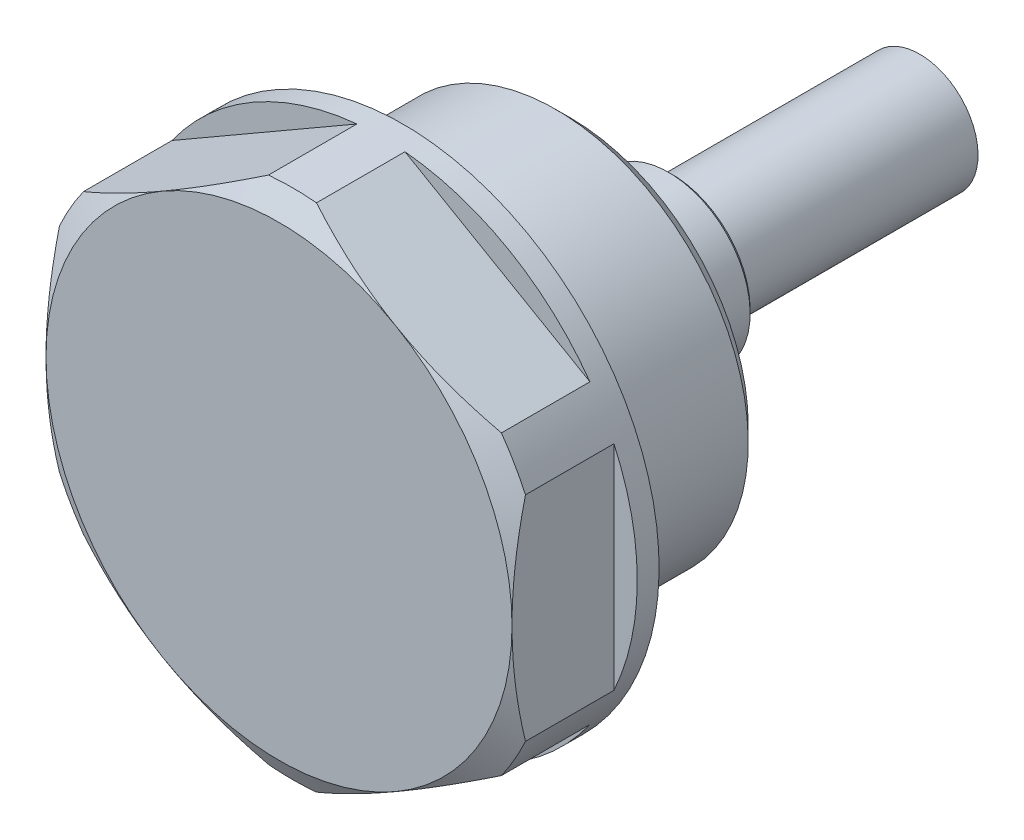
ISO-10303-21;
HEADER;
FILE_DESCRIPTION(('STEP AP214'),'2;1');
FILE_NAME('part.step','',(''),(''),'','','');
FILE_SCHEMA(('AUTOMOTIVE_DESIGN { 1 0 10303 214 1 1 1 1 }'));
ENDSEC;
DATA;
#1=APPLICATION_CONTEXT('core data for automotive mechanical design processes');
#2=APPLICATION_PROTOCOL_DEFINITION('international standard','automotive_design',2000,#1);
#3=PRODUCT_CONTEXT('',#1,'mechanical');
#4=PRODUCT('Part','Part','',(#3));
#5=PRODUCT_RELATED_PRODUCT_CATEGORY('part','',(#4));
#6=PRODUCT_DEFINITION_FORMATION('','',#4);
#7=PRODUCT_DEFINITION_CONTEXT('part definition',#1,'design');
#8=PRODUCT_DEFINITION('design','',#6,#7);
#9=PRODUCT_DEFINITION_SHAPE('','',#8);
#10=(LENGTH_UNIT() NAMED_UNIT(*) SI_UNIT(.MILLI.,.METRE.));
#11=(NAMED_UNIT(*) PLANE_ANGLE_UNIT() SI_UNIT($,.RADIAN.));
#12=(NAMED_UNIT(*) SI_UNIT($,.STERADIAN.) SOLID_ANGLE_UNIT());
#13=UNCERTAINTY_MEASURE_WITH_UNIT(LENGTH_MEASURE(1.E-05),#10,'distance_accuracy_value','');
#14=(GEOMETRIC_REPRESENTATION_CONTEXT(3) GLOBAL_UNCERTAINTY_ASSIGNED_CONTEXT((#13)) GLOBAL_UNIT_ASSIGNED_CONTEXT((#10,
#11,#12)) REPRESENTATION_CONTEXT('',''));
#15=CARTESIAN_POINT('',(0.,0.,0.));
#16=DIRECTION('',(0.,0.,1.));
#17=DIRECTION('',(1.,0.,0.));
#18=AXIS2_PLACEMENT_3D('',#15,#16,#17);
#19=CARTESIAN_POINT('',(0.,0.,9.));
#20=DIRECTION('',(0.,0.,-1.));
#21=DIRECTION('',(0.,-1.,0.));
#22=AXIS2_PLACEMENT_3D('',#19,#20,#21);
#23=CONICAL_SURFACE('',#22,16.,1.0471975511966);
#24=CARTESIAN_POINT('',(0.,0.,8.0762395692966));
#25=DIRECTION('',(0.,0.,-1.));
#26=DIRECTION('',(0.,-1.,0.));
#27=AXIS2_PLACEMENT_3D('',#24,#25,#26);
#28=CIRCLE('',#27,17.6);
#29=CARTESIAN_POINT('',(-1.65019685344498,17.5224670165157,8.07623956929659));
#30=VERTEX_POINT('',#29);
#31=CARTESIAN_POINT('',(1.65019685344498,17.5224670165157,8.0762395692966));
#32=VERTEX_POINT('',#31);
#33=EDGE_CURVE('E188',#30,#32,#28,.T.);
#34=ORIENTED_EDGE('',*,*,#33,.F.);
#35=CARTESIAN_POINT('',(-1.6494767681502,17.5228827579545,8.0760395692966));
#36=CARTESIAN_POINT('',(-1.98845285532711,17.327174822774,8.17020232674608));
#37=CARTESIAN_POINT('',(-2.32869743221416,17.130734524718,8.25847050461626));
#38=CARTESIAN_POINT('',(-3.01163532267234,16.7364401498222,8.42191829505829));
#39=CARTESIAN_POINT('',(-3.35432933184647,16.5385856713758,8.49709402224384));
#40=CARTESIAN_POINT('',(-4.04226988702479,16.1414030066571,8.63307784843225));
#41=CARTESIAN_POINT('',(-4.38751890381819,15.942073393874,8.69386941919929));
#42=CARTESIAN_POINT('',(-5.07979335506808,15.5423885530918,8.79975737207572));
#43=CARTESIAN_POINT('',(-5.42681860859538,15.3420334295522,8.84485532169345));
#44=CARTESIAN_POINT('',(-6.11541078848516,14.944474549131,8.91765204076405));
#45=CARTESIAN_POINT('',(-6.45695198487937,14.7472856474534,8.94567335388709));
#46=CARTESIAN_POINT('',(-7.14077192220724,14.3524820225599,8.98504305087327));
#47=CARTESIAN_POINT('',(-7.48305068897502,14.1548672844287,8.99639084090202));
#48=CARTESIAN_POINT('',(-8.16745430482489,13.7597266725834,9.00214002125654));
#49=CARTESIAN_POINT('',(-8.50957907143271,13.5622008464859,8.99655436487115));
#50=CARTESIAN_POINT('',(-9.19328411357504,13.1674635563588,8.96860000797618));
#51=CARTESIAN_POINT('',(-9.53486442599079,12.9702520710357,8.94623249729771));
#52=CARTESIAN_POINT('',(-10.2508802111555,12.5568601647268,8.88219224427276));
#53=CARTESIAN_POINT('',(-10.6252015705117,12.340745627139,8.83881945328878));
#54=CARTESIAN_POINT('',(-11.3719028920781,11.9096374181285,8.73353503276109));
#55=CARTESIAN_POINT('',(-11.7442826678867,11.6946438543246,8.67162165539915));
#56=CARTESIAN_POINT('',(-12.4907085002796,11.2636946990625,8.52994272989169));
#57=CARTESIAN_POINT('',(-12.864727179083,11.0477549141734,8.44998666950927));
#58=CARTESIAN_POINT('',(-13.6098439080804,10.617561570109,8.27436666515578));
#59=CARTESIAN_POINT('',(-13.9809430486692,10.4033073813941,8.17870890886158));
#60=CARTESIAN_POINT('',(-14.3505232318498,10.1899301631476,8.0760395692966));
#61=B_SPLINE_CURVE_WITH_KNOTS('',3,(#35,#36,#37,#38,#39,#40,#41,#42,#43,#44,#45,#46,#47,#48,#49,
#50,#51,#52,#53,#54,#55,#56,#57,#58,#59,#60),.UNSPECIFIED.,.F.,.F.,(4,2,2,2,2,2,2,2,2,2,2,2,4),
(0.,1.20777071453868,2.41589924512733,3.62540931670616,4.83479854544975,6.02057312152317,
7.20638992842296,8.39129987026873,9.5761258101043,10.8788915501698,12.1817801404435,
13.4991293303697,14.8159606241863),.UNSPECIFIED.);
#62=CARTESIAN_POINT('',(-8.,13.856406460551,9.));
#63=VERTEX_POINT('',#62);
#64=EDGE_CURVE('E291',#30,#63,#61,.T.);
#65=ORIENTED_EDGE('',*,*,#64,.T.);
#66=CARTESIAN_POINT('',(0.,0.,9.));
#67=DIRECTION('',(0.,0.,-1.));
#68=DIRECTION('',(0.,-1.,0.));
#69=AXIS2_PLACEMENT_3D('',#66,#67,#68);
#70=CIRCLE('',#69,16.);
#71=CARTESIAN_POINT('',(8.,13.856406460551,9.));
#72=VERTEX_POINT('',#71);
#73=EDGE_CURVE('E170',#63,#72,#70,.T.);
#74=ORIENTED_EDGE('',*,*,#73,.T.);
#75=CARTESIAN_POINT('',(14.3505232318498,10.1899301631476,8.0760395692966));
#76=CARTESIAN_POINT('',(14.0115471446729,10.385638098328,8.17020232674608));
#77=CARTESIAN_POINT('',(13.6713025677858,10.5820783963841,8.25847050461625));
#78=CARTESIAN_POINT('',(12.9883646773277,10.9763727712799,8.42191829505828));
#79=CARTESIAN_POINT('',(12.6456706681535,11.1742272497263,8.49709402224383));
#80=CARTESIAN_POINT('',(11.9577301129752,11.5714099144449,8.63307784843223));
#81=CARTESIAN_POINT('',(11.6124810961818,11.770739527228,8.69386941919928));
#82=CARTESIAN_POINT('',(10.9202066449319,12.1704243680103,8.7997573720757));
#83=CARTESIAN_POINT('',(10.5731813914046,12.3707794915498,8.84485532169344));
#84=CARTESIAN_POINT('',(9.88458921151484,12.7683383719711,8.91765204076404));
#85=CARTESIAN_POINT('',(9.54304801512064,12.9655272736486,8.94567335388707));
#86=CARTESIAN_POINT('',(8.85922807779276,13.3603308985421,8.98504305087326));
#87=CARTESIAN_POINT('',(8.51694931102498,13.5579456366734,8.99639084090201));
#88=CARTESIAN_POINT('',(7.83254569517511,13.9530862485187,9.00214002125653));
#89=CARTESIAN_POINT('',(7.4904209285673,14.1506120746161,8.99655436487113));
#90=CARTESIAN_POINT('',(6.80671588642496,14.5453493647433,8.96860000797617));
#91=CARTESIAN_POINT('',(6.46513557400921,14.7425608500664,8.9462324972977));
#92=CARTESIAN_POINT('',(5.74911978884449,15.1559527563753,8.88219224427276));
#93=CARTESIAN_POINT('',(5.37479842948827,15.372067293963,8.83881945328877));
#94=CARTESIAN_POINT('',(4.62809710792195,15.8031755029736,8.73353503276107));
#95=CARTESIAN_POINT('',(4.25571733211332,16.0181690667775,8.67162165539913));
#96=CARTESIAN_POINT('',(3.50929149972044,16.4491182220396,8.52994272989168));
#97=CARTESIAN_POINT('',(3.135272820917,16.6650580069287,8.44998666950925));
#98=CARTESIAN_POINT('',(2.39015609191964,17.095251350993,8.27436666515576));
#99=CARTESIAN_POINT('',(2.01905695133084,17.309505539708,8.17870890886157));
#100=CARTESIAN_POINT('',(1.64947676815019,17.5228827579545,8.0760395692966));
#101=B_SPLINE_CURVE_WITH_KNOTS('',3,(#75,#76,#77,#78,#79,#80,#81,#82,#83,#84,#85,#86,#87,#88,
#89,#90,#91,#92,#93,#94,#95,#96,#97,#98,#99,#100),.UNSPECIFIED.,.F.,.F.,(4,2,2,2,2,2,2,2,2,2,2,
2,4),(0.,1.20777071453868,2.41589924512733,3.62540931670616,4.83479854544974,6.02057312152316,
7.20638992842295,8.39129987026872,9.57612581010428,10.8788915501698,12.1817801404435,
13.4991293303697,14.8159606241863),.UNSPECIFIED.);
#102=EDGE_CURVE('E193',#72,#32,#101,.T.);
#103=ORIENTED_EDGE('',*,*,#102,.T.);
#104=EDGE_LOOP('',(#34,#65,#74,#103));
#105=FACE_BOUND('',#104,.T.);
#106=ADVANCED_FACE('F14',(#105),#23,.T.);
#107=CARTESIAN_POINT('',(-8.,-13.856406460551,9.));
#108=VERTEX_POINT('',#107);
#109=CARTESIAN_POINT('',(-16.,0.,9.));
#110=VERTEX_POINT('',#109);
#111=EDGE_CURVE('E171',#108,#110,#70,.T.);
#112=ORIENTED_EDGE('',*,*,#111,.T.);
#113=CARTESIAN_POINT('',(-16.,-24.4294713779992,1.37740391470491));
#114=CARTESIAN_POINT('',(-16.,-24.0785103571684,1.54690784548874));
#115=CARTESIAN_POINT('',(-16.,-23.72712313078,1.71552887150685));
#116=CARTESIAN_POINT('',(-16.,-23.023406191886,2.05080229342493));
#117=CARTESIAN_POINT('',(-16.,-22.6710764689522,2.21745466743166));
#118=CARTESIAN_POINT('',(-16.,-21.6124341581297,2.71420337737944));
#119=CARTESIAN_POINT('',(-16.,-20.9045837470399,3.04103544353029));
#120=CARTESIAN_POINT('',(-16.,-19.4798811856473,3.68575584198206));
#121=CARTESIAN_POINT('',(-16.,-18.7630006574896,4.0035816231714));
#122=CARTESIAN_POINT('',(-16.,-17.3233222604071,4.62548601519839));
#123=CARTESIAN_POINT('',(-16.,-16.6005247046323,4.92956534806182));
#124=CARTESIAN_POINT('',(-16.,-15.139216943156,5.52378605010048));
#125=CARTESIAN_POINT('',(-16.,-14.4006220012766,5.81372013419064));
#126=CARTESIAN_POINT('',(-16.,-12.914690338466,6.37070635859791));
#127=CARTESIAN_POINT('',(-16.,-12.167352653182,6.63775594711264));
#128=CARTESIAN_POINT('',(-16.,-10.6643298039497,7.14174292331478));
#129=CARTESIAN_POINT('',(-16.,-9.90866649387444,7.37874494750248));
#130=CARTESIAN_POINT('',(-16.,-8.3865273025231,7.81490580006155));
#131=CARTESIAN_POINT('',(-16.,-7.62005494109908,8.01407665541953));
#132=CARTESIAN_POINT('',(-16.,-6.46208899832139,8.27713785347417));
#133=CARTESIAN_POINT('',(-16.,-6.0746264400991,8.35889167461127));
#134=CARTESIAN_POINT('',(-16.,-5.29713679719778,8.50920089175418));
#135=CARTESIAN_POINT('',(-16.,-4.90710977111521,8.57775658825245));
#136=CARTESIAN_POINT('',(-16.,-4.12475809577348,8.70045020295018));
#137=CARTESIAN_POINT('',(-16.,-3.7324333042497,8.75458721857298));
#138=CARTESIAN_POINT('',(-16.,-2.94594126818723,8.84735381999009));
#139=CARTESIAN_POINT('',(-16.,-2.5517740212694,8.88598338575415));
#140=CARTESIAN_POINT('',(-16.,-1.7646332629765,8.94669888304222));
#141=CARTESIAN_POINT('',(-16.,-1.37166764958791,8.96888653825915));
#142=CARTESIAN_POINT('',(-16.,-0.585151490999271,8.99660263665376));
#143=CARTESIAN_POINT('',(-16.,-0.191600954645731,9.00213132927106));
#144=CARTESIAN_POINT('',(-16.,0.595272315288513,8.99639873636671));
#145=CARTESIAN_POINT('',(-16.,0.988595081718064,8.98514202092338));
#146=CARTESIAN_POINT('',(-16.,1.77442214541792,8.94611641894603));
#147=CARTESIAN_POINT('',(-16.,2.16692640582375,8.91834680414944));
#148=CARTESIAN_POINT('',(-16.,3.12020758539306,8.83142550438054));
#149=CARTESIAN_POINT('',(-16.,3.68023484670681,8.76389096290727));
#150=CARTESIAN_POINT('',(-16.,4.79585493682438,8.5989822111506));
#151=CARTESIAN_POINT('',(-16.,5.35144708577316,8.5016035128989));
#152=CARTESIAN_POINT('',(-16.,7.01256338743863,8.16959106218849));
#153=CARTESIAN_POINT('',(-16.,8.11025114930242,7.89530452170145));
#154=CARTESIAN_POINT('',(-16.,9.75207140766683,7.42294207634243));
#155=CARTESIAN_POINT('',(-16.,10.3047967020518,7.25304477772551));
#156=CARTESIAN_POINT('',(-16.,11.4049071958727,6.89645934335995));
#157=CARTESIAN_POINT('',(-16.,11.9522919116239,6.70976970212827));
#158=CARTESIAN_POINT('',(-16.,13.0389903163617,6.32356624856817));
#159=CARTESIAN_POINT('',(-16.,13.5783321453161,6.1241309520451));
#160=CARTESIAN_POINT('',(-16.,14.3839563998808,5.81641618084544));
#161=CARTESIAN_POINT('',(-16.,14.6518900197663,5.71243512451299));
#162=CARTESIAN_POINT('',(-16.,15.1867192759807,5.50185106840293));
#163=CARTESIAN_POINT('',(-16.,15.4536149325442,5.3952481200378));
#164=CARTESIAN_POINT('',(-16.,15.7200277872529,5.28745278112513));
#165=B_SPLINE_CURVE_WITH_KNOTS('',3,(#113,#114,#115,#116,#117,#118,#119,#120,#121,#122,#123,
#124,#125,#126,#127,#128,#129,#130,#131,#132,#133,#134,#135,#136,#137,#138,#139,#140,#141,#142,
#143,#144,#145,#146,#147,#148,#149,#150,#151,#152,#153,#154,#155,#156,#157,#158,#159,#160,#161,
#162,#163,#164),.UNSPECIFIED.,.F.,.F.,(4,2,2,2,2,2,2,2,2,2,2,2,2,2,2,2,2,2,2,2,2,2,2,2,2,4),(0.,
1.16924830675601,2.33850960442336,4.67741658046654,7.02983092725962,9.38212157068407,
11.7622223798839,14.1425882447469,16.5177434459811,18.8921422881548,20.0799344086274,
21.2676994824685,22.4555388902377,23.6433798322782,24.8238089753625,26.0042204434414,
27.1843105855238,28.3644527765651,30.055744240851,31.7472901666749,35.1369159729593,
36.8715249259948,38.6062895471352,40.331241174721,41.1934382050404,42.0556183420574),.UNSPECIFIED.);
#166=CARTESIAN_POINT('',(-16.,-7.33212111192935,8.0762395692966));
#167=VERTEX_POINT('',#166);
#168=EDGE_CURVE('E278',#110,#167,#165,.F.);
#169=ORIENTED_EDGE('',*,*,#168,.T.);
#170=CARTESIAN_POINT('',(-14.349803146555,-10.1903459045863,8.07623956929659));
#171=VERTEX_POINT('',#170);
#172=EDGE_CURVE('E347',#171,#167,#28,.T.);
#173=ORIENTED_EDGE('',*,*,#172,.F.);
#174=CARTESIAN_POINT('',(-14.3505232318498,-10.1899301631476,8.0760395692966));
#175=CARTESIAN_POINT('',(-14.0115471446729,-10.385638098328,8.17020232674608));
#176=CARTESIAN_POINT('',(-13.6713025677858,-10.5820783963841,8.25847050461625));
#177=CARTESIAN_POINT('',(-12.9883646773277,-10.9763727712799,8.42191829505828));
#178=CARTESIAN_POINT('',(-12.6456706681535,-11.1742272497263,8.49709402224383));
#179=CARTESIAN_POINT('',(-11.9577301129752,-11.5714099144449,8.63307784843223));
#180=CARTESIAN_POINT('',(-11.6124810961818,-11.770739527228,8.69386941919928));
#181=CARTESIAN_POINT('',(-10.9202066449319,-12.1704243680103,8.7997573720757));
#182=CARTESIAN_POINT('',(-10.5731813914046,-12.3707794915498,8.84485532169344));
#183=CARTESIAN_POINT('',(-9.88458921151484,-12.7683383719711,8.91765204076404));
#184=CARTESIAN_POINT('',(-9.54304801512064,-12.9655272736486,8.94567335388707));
#185=CARTESIAN_POINT('',(-8.85922807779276,-13.3603308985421,8.98504305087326));
#186=CARTESIAN_POINT('',(-8.51694931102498,-13.5579456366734,8.99639084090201));
#187=CARTESIAN_POINT('',(-7.83254569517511,-13.9530862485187,9.00214002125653));
#188=CARTESIAN_POINT('',(-7.4904209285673,-14.1506120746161,8.99655436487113));
#189=CARTESIAN_POINT('',(-6.80671588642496,-14.5453493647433,8.96860000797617));
#190=CARTESIAN_POINT('',(-6.46513557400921,-14.7425608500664,8.9462324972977));
#191=CARTESIAN_POINT('',(-5.74911978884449,-15.1559527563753,8.88219224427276));
#192=CARTESIAN_POINT('',(-5.37479842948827,-15.372067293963,8.83881945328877));
#193=CARTESIAN_POINT('',(-4.62809710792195,-15.8031755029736,8.73353503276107));
#194=CARTESIAN_POINT('',(-4.25571733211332,-16.0181690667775,8.67162165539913));
#195=CARTESIAN_POINT('',(-3.50929149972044,-16.4491182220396,8.52994272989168));
#196=CARTESIAN_POINT('',(-3.135272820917,-16.6650580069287,8.44998666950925));
#197=CARTESIAN_POINT('',(-2.39015609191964,-17.095251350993,8.27436666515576));
#198=CARTESIAN_POINT('',(-2.01905695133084,-17.309505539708,8.17870890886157));
#199=CARTESIAN_POINT('',(-1.64947676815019,-17.5228827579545,8.0760395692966));
#200=B_SPLINE_CURVE_WITH_KNOTS('',3,(#174,#175,#176,#177,#178,#179,#180,#181,#182,#183,#184,
#185,#186,#187,#188,#189,#190,#191,#192,#193,#194,#195,#196,#197,#198,#199),.UNSPECIFIED.,.F.,
.F.,(4,2,2,2,2,2,2,2,2,2,2,2,4),(0.,1.20777071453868,2.41589924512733,3.62540931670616,
4.83479854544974,6.02057312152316,7.20638992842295,8.39129987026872,9.57612581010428,
10.8788915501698,12.1817801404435,13.4991293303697,14.8159606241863),.UNSPECIFIED.);
#201=EDGE_CURVE('E279',#171,#108,#200,.T.);
#202=ORIENTED_EDGE('',*,*,#201,.T.);
#203=EDGE_LOOP('',(#112,#169,#173,#202));
#204=FACE_BOUND('',#203,.T.);
#205=ADVANCED_FACE('F262',(#204),#23,.T.);
#206=CARTESIAN_POINT('',(8.,-13.856406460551,9.));
#207=VERTEX_POINT('',#206);
#208=EDGE_CURVE('E283',#207,#108,#70,.T.);
#209=ORIENTED_EDGE('',*,*,#208,.T.);
#210=CARTESIAN_POINT('',(-1.65019685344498,-17.5224670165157,8.0762395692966));
#211=VERTEX_POINT('',#210);
#212=EDGE_CURVE('E289',#108,#211,#200,.T.);
#213=ORIENTED_EDGE('',*,*,#212,.T.);
#214=CARTESIAN_POINT('',(1.65019685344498,-17.5224670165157,8.07623956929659));
#215=VERTEX_POINT('',#214);
#216=EDGE_CURVE('E346',#215,#211,#28,.T.);
#217=ORIENTED_EDGE('',*,*,#216,.F.);
#218=CARTESIAN_POINT('',(1.6494767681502,-17.5228827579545,8.0760395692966));
#219=CARTESIAN_POINT('',(1.98845285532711,-17.327174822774,8.17020232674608));
#220=CARTESIAN_POINT('',(2.32869743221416,-17.130734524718,8.25847050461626));
#221=CARTESIAN_POINT('',(3.01163532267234,-16.7364401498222,8.42191829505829));
#222=CARTESIAN_POINT('',(3.35432933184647,-16.5385856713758,8.49709402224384));
#223=CARTESIAN_POINT('',(4.04226988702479,-16.1414030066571,8.63307784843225));
#224=CARTESIAN_POINT('',(4.38751890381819,-15.942073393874,8.69386941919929));
#225=CARTESIAN_POINT('',(5.07979335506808,-15.5423885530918,8.79975737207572));
#226=CARTESIAN_POINT('',(5.42681860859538,-15.3420334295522,8.84485532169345));
#227=CARTESIAN_POINT('',(6.11541078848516,-14.944474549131,8.91765204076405));
#228=CARTESIAN_POINT('',(6.45695198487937,-14.7472856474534,8.94567335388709));
#229=CARTESIAN_POINT('',(7.14077192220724,-14.3524820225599,8.98504305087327));
#230=CARTESIAN_POINT('',(7.48305068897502,-14.1548672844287,8.99639084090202));
#231=CARTESIAN_POINT('',(8.16745430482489,-13.7597266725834,9.00214002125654));
#232=CARTESIAN_POINT('',(8.50957907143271,-13.5622008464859,8.99655436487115));
#233=CARTESIAN_POINT('',(9.19328411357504,-13.1674635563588,8.96860000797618));
#234=CARTESIAN_POINT('',(9.53486442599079,-12.9702520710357,8.94623249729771));
#235=CARTESIAN_POINT('',(10.2508802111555,-12.5568601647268,8.88219224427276));
#236=CARTESIAN_POINT('',(10.6252015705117,-12.340745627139,8.83881945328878));
#237=CARTESIAN_POINT('',(11.3719028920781,-11.9096374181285,8.73353503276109));
#238=CARTESIAN_POINT('',(11.7442826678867,-11.6946438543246,8.67162165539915));
#239=CARTESIAN_POINT('',(12.4907085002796,-11.2636946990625,8.52994272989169));
#240=CARTESIAN_POINT('',(12.864727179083,-11.0477549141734,8.44998666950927));
#241=CARTESIAN_POINT('',(13.6098439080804,-10.617561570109,8.27436666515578));
#242=CARTESIAN_POINT('',(13.9809430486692,-10.4033073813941,8.17870890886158));
#243=CARTESIAN_POINT('',(14.3505232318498,-10.1899301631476,8.0760395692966));
#244=B_SPLINE_CURVE_WITH_KNOTS('',3,(#218,#219,#220,#221,#222,#223,#224,#225,#226,#227,#228,
#229,#230,#231,#232,#233,#234,#235,#236,#237,#238,#239,#240,#241,#242,#243),.UNSPECIFIED.,.F.,
.F.,(4,2,2,2,2,2,2,2,2,2,2,2,4),(0.,1.20777071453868,2.41589924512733,3.62540931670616,
4.83479854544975,6.02057312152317,7.20638992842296,8.39129987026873,9.5761258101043,
10.8788915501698,12.1817801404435,13.4991293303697,14.8159606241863),.UNSPECIFIED.);
#245=EDGE_CURVE('E327',#215,#207,#244,.T.);
#246=ORIENTED_EDGE('',*,*,#245,.T.);
#247=EDGE_LOOP('',(#209,#213,#217,#246));
#248=FACE_BOUND('',#247,.T.);
#249=ADVANCED_FACE('F266',(#248),#23,.T.);
#250=CARTESIAN_POINT('',(16.,0.,9.));
#251=VERTEX_POINT('',#250);
#252=EDGE_CURVE('E459',#251,#207,#70,.T.);
#253=ORIENTED_EDGE('',*,*,#252,.T.);
#254=CARTESIAN_POINT('',(14.349803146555,-10.1903459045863,8.0762395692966));
#255=VERTEX_POINT('',#254);
#256=EDGE_CURVE('E333',#207,#255,#244,.T.);
#257=ORIENTED_EDGE('',*,*,#256,.T.);
#258=CARTESIAN_POINT('',(16.,-7.33212111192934,8.07623956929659));
#259=VERTEX_POINT('',#258);
#260=EDGE_CURVE('E343',#259,#255,#28,.T.);
#261=ORIENTED_EDGE('',*,*,#260,.F.);
#262=CARTESIAN_POINT('',(16.,-24.4294713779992,1.37740391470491));
#263=CARTESIAN_POINT('',(16.,-24.0785103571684,1.54690784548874));
#264=CARTESIAN_POINT('',(16.,-23.72712313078,1.71552887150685));
#265=CARTESIAN_POINT('',(16.,-23.023406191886,2.05080229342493));
#266=CARTESIAN_POINT('',(16.,-22.6710764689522,2.21745466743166));
#267=CARTESIAN_POINT('',(16.,-21.6124341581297,2.71420337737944));
#268=CARTESIAN_POINT('',(16.,-20.9045837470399,3.04103544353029));
#269=CARTESIAN_POINT('',(16.,-19.4798811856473,3.68575584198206));
#270=CARTESIAN_POINT('',(16.,-18.7630006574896,4.0035816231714));
#271=CARTESIAN_POINT('',(16.,-17.3233222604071,4.62548601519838));
#272=CARTESIAN_POINT('',(16.,-16.6005247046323,4.92956534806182));
#273=CARTESIAN_POINT('',(16.,-15.139216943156,5.52378605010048));
#274=CARTESIAN_POINT('',(16.,-14.4006220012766,5.81372013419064));
#275=CARTESIAN_POINT('',(16.,-12.914690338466,6.3707063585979));
#276=CARTESIAN_POINT('',(16.,-12.167352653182,6.63775594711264));
#277=CARTESIAN_POINT('',(16.,-10.6643298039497,7.14174292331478));
#278=CARTESIAN_POINT('',(16.,-9.90866649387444,7.37874494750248));
#279=CARTESIAN_POINT('',(16.,-8.3865273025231,7.81490580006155));
#280=CARTESIAN_POINT('',(16.,-7.62005494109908,8.01407665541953));
#281=CARTESIAN_POINT('',(16.,-6.46208899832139,8.27713785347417));
#282=CARTESIAN_POINT('',(16.,-6.0746264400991,8.35889167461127));
#283=CARTESIAN_POINT('',(16.,-5.29713679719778,8.50920089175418));
#284=CARTESIAN_POINT('',(16.,-4.90710977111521,8.57775658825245));
#285=CARTESIAN_POINT('',(16.,-4.12475809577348,8.70045020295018));
#286=CARTESIAN_POINT('',(16.,-3.7324333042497,8.75458721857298));
#287=CARTESIAN_POINT('',(16.,-2.94594126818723,8.84735381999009));
#288=CARTESIAN_POINT('',(16.,-2.5517740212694,8.88598338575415));
#289=CARTESIAN_POINT('',(16.,-1.7646332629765,8.94669888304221));
#290=CARTESIAN_POINT('',(16.,-1.37166764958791,8.96888653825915));
#291=CARTESIAN_POINT('',(16.,-0.585151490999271,8.99660263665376));
#292=CARTESIAN_POINT('',(16.,-0.191600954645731,9.00213132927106));
#293=CARTESIAN_POINT('',(16.,0.595272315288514,8.99639873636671));
#294=CARTESIAN_POINT('',(16.,0.988595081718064,8.98514202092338));
#295=CARTESIAN_POINT('',(16.,1.77442214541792,8.94611641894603));
#296=CARTESIAN_POINT('',(16.,2.16692640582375,8.91834680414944));
#297=CARTESIAN_POINT('',(16.,3.12020758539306,8.83142550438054));
#298=CARTESIAN_POINT('',(16.,3.68023484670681,8.76389096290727));
#299=CARTESIAN_POINT('',(16.,4.79585493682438,8.5989822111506));
#300=CARTESIAN_POINT('',(16.,5.35144708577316,8.5016035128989));
#301=CARTESIAN_POINT('',(16.,7.01256338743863,8.16959106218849));
#302=CARTESIAN_POINT('',(16.,8.11025114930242,7.89530452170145));
#303=CARTESIAN_POINT('',(16.,9.75207140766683,7.42294207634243));
#304=CARTESIAN_POINT('',(16.,10.3047967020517,7.25304477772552));
#305=CARTESIAN_POINT('',(16.,11.4049071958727,6.89645934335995));
#306=CARTESIAN_POINT('',(16.,11.9522919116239,6.70976970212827));
#307=CARTESIAN_POINT('',(16.,13.0389903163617,6.32356624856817));
#308=CARTESIAN_POINT('',(16.,13.5783321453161,6.12413095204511));
#309=CARTESIAN_POINT('',(16.,14.3839563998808,5.81641618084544));
#310=CARTESIAN_POINT('',(16.,14.6518900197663,5.712435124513));
#311=CARTESIAN_POINT('',(16.,15.1867192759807,5.50185106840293));
#312=CARTESIAN_POINT('',(16.,15.4536149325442,5.3952481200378));
#313=CARTESIAN_POINT('',(16.,15.7200277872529,5.28745278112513));
#314=B_SPLINE_CURVE_WITH_KNOTS('',3,(#262,#263,#264,#265,#266,#267,#268,#269,#270,#271,#272,
#273,#274,#275,#276,#277,#278,#279,#280,#281,#282,#283,#284,#285,#286,#287,#288,#289,#290,#291,
#292,#293,#294,#295,#296,#297,#298,#299,#300,#301,#302,#303,#304,#305,#306,#307,#308,#309,#310,
#311,#312,#313),.UNSPECIFIED.,.F.,.F.,(4,2,2,2,2,2,2,2,2,2,2,2,2,2,2,2,2,2,2,2,2,2,2,2,2,4),(0.,
1.16924830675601,2.33850960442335,4.67741658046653,7.02983092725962,9.38212157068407,
11.7622223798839,14.1425882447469,16.5177434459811,18.8921422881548,20.0799344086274,
21.2676994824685,22.4555388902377,23.6433798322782,24.8238089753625,26.0042204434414,
27.1843105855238,28.3644527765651,30.055744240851,31.7472901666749,35.1369159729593,
36.8715249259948,38.6062895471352,40.331241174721,41.1934382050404,42.0556183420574),.UNSPECIFIED.);
#315=EDGE_CURVE('E201',#259,#251,#314,.T.);
#316=ORIENTED_EDGE('',*,*,#315,.T.);
#317=EDGE_LOOP('',(#253,#257,#261,#316));
#318=FACE_BOUND('',#317,.T.);
#319=ADVANCED_FACE('F271',(#318),#23,.T.);
#320=EDGE_CURVE('E341',#72,#251,#70,.T.);
#321=ORIENTED_EDGE('',*,*,#320,.T.);
#322=CARTESIAN_POINT('',(16.,7.33212111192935,8.0762395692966));
#323=VERTEX_POINT('',#322);
#324=EDGE_CURVE('E204',#251,#323,#314,.T.);
#325=ORIENTED_EDGE('',*,*,#324,.T.);
#326=CARTESIAN_POINT('',(14.349803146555,10.1903459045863,8.07623956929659));
#327=VERTEX_POINT('',#326);
#328=EDGE_CURVE('E340',#327,#323,#28,.T.);
#329=ORIENTED_EDGE('',*,*,#328,.F.);
#330=EDGE_CURVE('E137',#327,#72,#101,.T.);
#331=ORIENTED_EDGE('',*,*,#330,.T.);
#332=EDGE_LOOP('',(#321,#325,#329,#331));
#333=FACE_BOUND('',#332,.T.);
#334=ADVANCED_FACE('F259',(#333),#23,.T.);
#335=CARTESIAN_POINT('',(0.,0.,9.));
#336=DIRECTION('',(0.,0.,-1.));
#337=DIRECTION('',(0.,-1.,0.));
#338=AXIS2_PLACEMENT_3D('',#335,#336,#337);
#339=PLANE('',#338);
#340=EDGE_CURVE('E164',#110,#63,#70,.T.);
#341=ORIENTED_EDGE('',*,*,#340,.F.);
#342=ORIENTED_EDGE('',*,*,#111,.F.);
#343=ORIENTED_EDGE('',*,*,#208,.F.);
#344=ORIENTED_EDGE('',*,*,#252,.F.);
#345=ORIENTED_EDGE('',*,*,#320,.F.);
#346=ORIENTED_EDGE('',*,*,#73,.F.);
#347=EDGE_LOOP('',(#341,#342,#343,#344,#345,#346));
#348=FACE_BOUND('',#347,.T.);
#349=ADVANCED_FACE('F16',(#348),#339,.F.);
#350=ORIENTED_EDGE('',*,*,#340,.T.);
#351=CARTESIAN_POINT('',(-14.349803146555,10.1903459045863,8.0762395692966));
#352=VERTEX_POINT('',#351);
#353=EDGE_CURVE('E286',#63,#352,#61,.T.);
#354=ORIENTED_EDGE('',*,*,#353,.T.);
#355=CARTESIAN_POINT('',(-16.,7.33212111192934,8.07623956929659));
#356=VERTEX_POINT('',#355);
#357=EDGE_CURVE('E144',#356,#352,#28,.T.);
#358=ORIENTED_EDGE('',*,*,#357,.F.);
#359=EDGE_CURVE('E287',#356,#110,#165,.F.);
#360=ORIENTED_EDGE('',*,*,#359,.T.);
#361=EDGE_LOOP('',(#350,#354,#358,#360));
#362=FACE_BOUND('',#361,.T.);
#363=ADVANCED_FACE('F218',(#362),#23,.T.);
#364=CARTESIAN_POINT('',(0.,0.,-35.));
#365=DIRECTION('',(0.,0.,-1.));
#366=DIRECTION('',(0.,-1.,0.));
#367=AXIS2_PLACEMENT_3D('',#364,#365,#366);
#368=CYLINDRICAL_SURFACE('',#367,17.6);
#369=CARTESIAN_POINT('',(0.,0.,0.5));
#370=DIRECTION('',(0.,0.,-1.));
#371=DIRECTION('',(0.,-1.,0.));
#372=AXIS2_PLACEMENT_3D('',#369,#370,#371);
#373=CIRCLE('',#372,17.6);
#374=CARTESIAN_POINT('',(0.,-17.6,0.5));
#375=VERTEX_POINT('',#374);
#376=EDGE_CURVE('E349',#375,#375,#373,.T.);
#377=ORIENTED_EDGE('',*,*,#376,.F.);
#378=EDGE_LOOP('',(#377));
#379=FACE_BOUND('',#378,.T.);
#380=ORIENTED_EDGE('',*,*,#216,.T.);
#381=DIRECTION('',(0.,0.,-1.));
#382=VECTOR('',#381,1.);
#383=CARTESIAN_POINT('',(-1.65019685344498,-17.5224670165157,-35.));
#384=LINE('',#383,#382);
#385=CARTESIAN_POINT('',(-1.65019685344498,-17.5224670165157,2.));
#386=VERTEX_POINT('',#385);
#387=EDGE_CURVE('E9',#211,#386,#384,.T.);
#388=ORIENTED_EDGE('',*,*,#387,.T.);
#389=CARTESIAN_POINT('',(0.,0.,2.));
#390=DIRECTION('',(0.,0.,-1.));
#391=DIRECTION('',(0.,-1.,0.));
#392=AXIS2_PLACEMENT_3D('',#389,#390,#391);
#393=CIRCLE('',#392,17.6);
#394=CARTESIAN_POINT('',(-14.349803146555,-10.1903459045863,2.));
#395=VERTEX_POINT('',#394);
#396=EDGE_CURVE('E148',#386,#395,#393,.T.);
#397=ORIENTED_EDGE('',*,*,#396,.T.);
#398=DIRECTION('',(0.,0.,-1.));
#399=VECTOR('',#398,1.);
#400=CARTESIAN_POINT('',(-14.349803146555,-10.1903459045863,-35.));
#401=LINE('',#400,#399);
#402=EDGE_CURVE('E22',#395,#171,#401,.F.);
#403=ORIENTED_EDGE('',*,*,#402,.T.);
#404=ORIENTED_EDGE('',*,*,#172,.T.);
#405=DIRECTION('',(0.,0.,-1.));
#406=VECTOR('',#405,1.);
#407=CARTESIAN_POINT('',(-16.,-7.33212111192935,-35.));
#408=LINE('',#407,#406);
#409=CARTESIAN_POINT('',(-16.,-7.33212111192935,2.));
#410=VERTEX_POINT('',#409);
#411=EDGE_CURVE('E153',#167,#410,#408,.T.);
#412=ORIENTED_EDGE('',*,*,#411,.T.);
#413=CARTESIAN_POINT('',(-16.,7.33212111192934,2.));
#414=VERTEX_POINT('',#413);
#415=EDGE_CURVE('E132',#410,#414,#393,.T.);
#416=ORIENTED_EDGE('',*,*,#415,.T.);
#417=DIRECTION('',(0.,0.,-1.));
#418=VECTOR('',#417,1.);
#419=CARTESIAN_POINT('',(-16.,7.33212111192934,-35.));
#420=LINE('',#419,#418);
#421=EDGE_CURVE('E147',#414,#356,#420,.F.);
#422=ORIENTED_EDGE('',*,*,#421,.T.);
#423=ORIENTED_EDGE('',*,*,#357,.T.);
#424=DIRECTION('',(0.,0.,-1.));
#425=VECTOR('',#424,1.);
#426=CARTESIAN_POINT('',(-14.349803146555,10.1903459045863,-35.));
#427=LINE('',#426,#425);
#428=CARTESIAN_POINT('',(-14.349803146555,10.1903459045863,2.));
#429=VERTEX_POINT('',#428);
#430=EDGE_CURVE('E135',#352,#429,#427,.T.);
#431=ORIENTED_EDGE('',*,*,#430,.T.);
#432=CARTESIAN_POINT('',(-1.65019685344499,17.5224670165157,2.));
#433=VERTEX_POINT('',#432);
#434=EDGE_CURVE('E120',#429,#433,#393,.T.);
#435=ORIENTED_EDGE('',*,*,#434,.T.);
#436=DIRECTION('',(0.,0.,-1.));
#437=VECTOR('',#436,1.);
#438=CARTESIAN_POINT('',(-1.65019685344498,17.5224670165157,-35.));
#439=LINE('',#438,#437);
#440=EDGE_CURVE('E128',#433,#30,#439,.F.);
#441=ORIENTED_EDGE('',*,*,#440,.T.);
#442=ORIENTED_EDGE('',*,*,#33,.T.);
#443=DIRECTION('',(0.,0.,-1.));
#444=VECTOR('',#443,1.);
#445=CARTESIAN_POINT('',(1.65019685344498,17.5224670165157,-35.));
#446=LINE('',#445,#444);
#447=CARTESIAN_POINT('',(1.65019685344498,17.5224670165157,2.));
#448=VERTEX_POINT('',#447);
#449=EDGE_CURVE('E129',#32,#448,#446,.T.);
#450=ORIENTED_EDGE('',*,*,#449,.T.);
#451=CARTESIAN_POINT('',(14.349803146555,10.1903459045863,2.));
#452=VERTEX_POINT('',#451);
#453=EDGE_CURVE('E131',#448,#452,#393,.T.);
#454=ORIENTED_EDGE('',*,*,#453,.T.);
#455=DIRECTION('',(0.,0.,-1.));
#456=VECTOR('',#455,1.);
#457=CARTESIAN_POINT('',(14.349803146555,10.1903459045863,-35.));
#458=LINE('',#457,#456);
#459=EDGE_CURVE('E180',#452,#327,#458,.F.);
#460=ORIENTED_EDGE('',*,*,#459,.T.);
#461=ORIENTED_EDGE('',*,*,#328,.T.);
#462=DIRECTION('',(0.,0.,-1.));
#463=VECTOR('',#462,1.);
#464=CARTESIAN_POINT('',(16.,7.33212111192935,-35.));
#465=LINE('',#464,#463);
#466=CARTESIAN_POINT('',(16.,7.33212111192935,2.));
#467=VERTEX_POINT('',#466);
#468=EDGE_CURVE('E176',#323,#467,#465,.T.);
#469=ORIENTED_EDGE('',*,*,#468,.T.);
#470=CARTESIAN_POINT('',(16.,-7.33212111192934,2.));
#471=VERTEX_POINT('',#470);
#472=EDGE_CURVE('E165',#467,#471,#393,.T.);
#473=ORIENTED_EDGE('',*,*,#472,.T.);
#474=DIRECTION('',(0.,0.,-1.));
#475=VECTOR('',#474,1.);
#476=CARTESIAN_POINT('',(16.,-7.33212111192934,-35.));
#477=LINE('',#476,#475);
#478=EDGE_CURVE('E173',#471,#259,#477,.F.);
#479=ORIENTED_EDGE('',*,*,#478,.T.);
#480=ORIENTED_EDGE('',*,*,#260,.T.);
#481=DIRECTION('',(0.,0.,-1.));
#482=VECTOR('',#481,1.);
#483=CARTESIAN_POINT('',(14.349803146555,-10.1903459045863,-35.));
#484=LINE('',#483,#482);
#485=CARTESIAN_POINT('',(14.349803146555,-10.1903459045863,2.));
#486=VERTEX_POINT('',#485);
#487=EDGE_CURVE('E168',#255,#486,#484,.T.);
#488=ORIENTED_EDGE('',*,*,#487,.T.);
#489=CARTESIAN_POINT('',(1.65019685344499,-17.5224670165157,2.));
#490=VERTEX_POINT('',#489);
#491=EDGE_CURVE('E159',#486,#490,#393,.T.);
#492=ORIENTED_EDGE('',*,*,#491,.T.);
#493=DIRECTION('',(0.,0.,-1.));
#494=VECTOR('',#493,1.);
#495=CARTESIAN_POINT('',(1.65019685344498,-17.5224670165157,-35.));
#496=LINE('',#495,#494);
#497=EDGE_CURVE('E163',#490,#215,#496,.F.);
#498=ORIENTED_EDGE('',*,*,#497,.T.);
#499=EDGE_LOOP('',(#380,#388,#397,#403,#404,#412,#416,#422,#423,#431,#435,#441,#442,#450,#454,
#460,#461,#469,#473,#479,#480,#488,#492,#498));
#500=FACE_BOUND('',#499,.T.);
#501=ADVANCED_FACE('F141',(#379,#500),#368,.T.);
#502=CARTESIAN_POINT('',(-17.6,0.,0.5));
#503=DIRECTION('',(0.,0.,1.));
#504=DIRECTION('',(0.,1.,0.));
#505=AXIS2_PLACEMENT_3D('',#502,#503,#504);
#506=PLANE('',#505);
#507=CARTESIAN_POINT('',(0.,0.,0.5));
#508=DIRECTION('',(0.,0.,-1.));
#509=DIRECTION('',(0.,-1.,0.));
#510=AXIS2_PLACEMENT_3D('',#507,#508,#509);
#511=CIRCLE('',#510,14.2871666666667);
#512=CARTESIAN_POINT('',(0.,-14.2871666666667,0.5));
#513=VERTEX_POINT('',#512);
#514=EDGE_CURVE('E352',#513,#513,#511,.T.);
#515=ORIENTED_EDGE('',*,*,#514,.F.);
#516=EDGE_LOOP('',(#515));
#517=FACE_BOUND('',#516,.T.);
#518=ORIENTED_EDGE('',*,*,#376,.T.);
#519=EDGE_LOOP('',(#518));
#520=FACE_BOUND('',#519,.T.);
#521=ADVANCED_FACE('F248',(#517,#520),#506,.F.);
#522=CARTESIAN_POINT('',(0.,0.,-35.));
#523=DIRECTION('',(0.,0.,-1.));
#524=DIRECTION('',(0.,-1.,0.));
#525=AXIS2_PLACEMENT_3D('',#522,#523,#524);
#526=CYLINDRICAL_SURFACE('',#525,14.2871666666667);
#527=CARTESIAN_POINT('',(0.,0.,0.));
#528=DIRECTION('',(0.,0.,-1.));
#529=DIRECTION('',(0.,-1.,0.));
#530=AXIS2_PLACEMENT_3D('',#527,#528,#529);
#531=CIRCLE('',#530,14.2871666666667);
#532=CARTESIAN_POINT('',(0.,-14.2871666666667,0.));
#533=VERTEX_POINT('',#532);
#534=EDGE_CURVE('E355',#533,#533,#531,.T.);
#535=ORIENTED_EDGE('',*,*,#534,.F.);
#536=EDGE_LOOP('',(#535));
#537=FACE_BOUND('',#536,.T.);
#538=ORIENTED_EDGE('',*,*,#514,.T.);
#539=EDGE_LOOP('',(#538));
#540=FACE_BOUND('',#539,.T.);
#541=ADVANCED_FACE('F244',(#537,#540),#526,.T.);
#542=CARTESIAN_POINT('',(-14.2871666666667,0.,0.));
#543=DIRECTION('',(0.,0.,1.));
#544=DIRECTION('',(0.,1.,0.));
#545=AXIS2_PLACEMENT_3D('',#542,#543,#544);
#546=PLANE('',#545);
#547=CARTESIAN_POINT('',(0.,0.,0.));
#548=DIRECTION('',(0.,0.,-1.));
#549=DIRECTION('',(0.,-1.,0.));
#550=AXIS2_PLACEMENT_3D('',#547,#548,#549);
#551=CIRCLE('',#550,13.2205);
#552=CARTESIAN_POINT('',(0.,-13.2205,0.));
#553=VERTEX_POINT('',#552);
#554=EDGE_CURVE('E358',#553,#553,#551,.T.);
#555=ORIENTED_EDGE('',*,*,#554,.F.);
#556=EDGE_LOOP('',(#555));
#557=FACE_BOUND('',#556,.T.);
#558=ORIENTED_EDGE('',*,*,#534,.T.);
#559=EDGE_LOOP('',(#558));
#560=FACE_BOUND('',#559,.T.);
#561=ADVANCED_FACE('F240',(#557,#560),#546,.F.);
#562=CARTESIAN_POINT('',(0.,0.,-35.));
#563=DIRECTION('',(0.,0.,-1.));
#564=DIRECTION('',(0.,-1.,0.));
#565=AXIS2_PLACEMENT_3D('',#562,#563,#564);
#566=CYLINDRICAL_SURFACE('',#565,13.2205);
#567=CARTESIAN_POINT('',(0.,0.,0.5));
#568=DIRECTION('',(0.,0.,-1.));
#569=DIRECTION('',(0.,-1.,0.));
#570=AXIS2_PLACEMENT_3D('',#567,#568,#569);
#571=CIRCLE('',#570,13.2205);
#572=CARTESIAN_POINT('',(0.,-13.2205,0.5));
#573=VERTEX_POINT('',#572);
#574=EDGE_CURVE('E361',#573,#573,#571,.T.);
#575=ORIENTED_EDGE('',*,*,#574,.F.);
#576=EDGE_LOOP('',(#575));
#577=FACE_BOUND('',#576,.T.);
#578=ORIENTED_EDGE('',*,*,#554,.T.);
#579=EDGE_LOOP('',(#578));
#580=FACE_BOUND('',#579,.T.);
#581=ADVANCED_FACE('F236',(#577,#580),#566,.F.);
#582=CARTESIAN_POINT('',(-13.2205,0.,0.5));
#583=DIRECTION('',(0.,0.,1.));
#584=DIRECTION('',(0.,1.,0.));
#585=AXIS2_PLACEMENT_3D('',#582,#583,#584);
#586=PLANE('',#585);
#587=CARTESIAN_POINT('',(0.,0.,0.5));
#588=DIRECTION('',(0.,0.,-1.));
#589=DIRECTION('',(0.,-1.,0.));
#590=AXIS2_PLACEMENT_3D('',#587,#588,#589);
#591=CIRCLE('',#590,10.5764);
#592=CARTESIAN_POINT('',(0.,-10.5764,0.5));
#593=VERTEX_POINT('',#592);
#594=EDGE_CURVE('E364',#593,#593,#591,.T.);
#595=ORIENTED_EDGE('',*,*,#594,.F.);
#596=EDGE_LOOP('',(#595));
#597=FACE_BOUND('',#596,.T.);
#598=ORIENTED_EDGE('',*,*,#574,.T.);
#599=EDGE_LOOP('',(#598));
#600=FACE_BOUND('',#599,.T.);
#601=ADVANCED_FACE('F232',(#597,#600),#586,.F.);
#602=CARTESIAN_POINT('',(0.,0.,-35.));
#603=DIRECTION('',(0.,0.,-1.));
#604=DIRECTION('',(0.,-1.,0.));
#605=AXIS2_PLACEMENT_3D('',#602,#603,#604);
#606=CYLINDRICAL_SURFACE('',#605,10.5764);
#607=CARTESIAN_POINT('',(0.,0.,-0.5));
#608=DIRECTION('',(0.,0.,-1.));
#609=DIRECTION('',(0.,-1.,0.));
#610=AXIS2_PLACEMENT_3D('',#607,#608,#609);
#611=CIRCLE('',#610,10.5764);
#612=CARTESIAN_POINT('',(0.,-10.5764,-0.5));
#613=VERTEX_POINT('',#612);
#614=EDGE_CURVE('E366',#613,#613,#611,.T.);
#615=ORIENTED_EDGE('',*,*,#614,.F.);
#616=EDGE_LOOP('',(#615));
#617=FACE_BOUND('',#616,.T.);
#618=ORIENTED_EDGE('',*,*,#594,.T.);
#619=EDGE_LOOP('',(#618));
#620=FACE_BOUND('',#619,.T.);
#621=ADVANCED_FACE('F228',(#617,#620),#606,.T.);
#622=CARTESIAN_POINT('',(0.,0.,2.));
#623=DIRECTION('',(0.,0.,-1.));
#624=DIRECTION('',(0.,-1.,0.));
#625=AXIS2_PLACEMENT_3D('',#622,#623,#624);
#626=PLANE('',#625);
#627=DIRECTION('',(-0.866025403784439,-0.5,0.));
#628=VECTOR('',#627,1.);
#629=CARTESIAN_POINT('',(16.,-9.23760430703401,2.));
#630=LINE('',#629,#628);
#631=EDGE_CURVE('E452',#486,#490,#630,.T.);
#632=ORIENTED_EDGE('',*,*,#631,.T.);
#633=ORIENTED_EDGE('',*,*,#491,.F.);
#634=EDGE_LOOP('',(#632,#633));
#635=FACE_BOUND('',#634,.T.);
#636=ADVANCED_FACE('F231',(#635),#626,.F.);
#637=CARTESIAN_POINT('',(16.,-9.23760430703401,2.));
#638=DIRECTION('',(-0.5,0.866025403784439,0.));
#639=DIRECTION('',(0.866025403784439,0.5,0.));
#640=AXIS2_PLACEMENT_3D('',#637,#638,#639);
#641=PLANE('',#640);
#642=ORIENTED_EDGE('',*,*,#256,.F.);
#643=ORIENTED_EDGE('',*,*,#245,.F.);
#644=ORIENTED_EDGE('',*,*,#497,.F.);
#645=ORIENTED_EDGE('',*,*,#631,.F.);
#646=ORIENTED_EDGE('',*,*,#487,.F.);
#647=EDGE_LOOP('',(#642,#643,#644,#645,#646));
#648=FACE_BOUND('',#647,.T.);
#649=ADVANCED_FACE('F322',(#648),#641,.F.);
#650=DIRECTION('',(0.,-1.,0.));
#651=VECTOR('',#650,1.);
#652=CARTESIAN_POINT('',(16.,9.23760430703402,2.));
#653=LINE('',#652,#651);
#654=EDGE_CURVE('E450',#467,#471,#653,.T.);
#655=ORIENTED_EDGE('',*,*,#654,.T.);
#656=ORIENTED_EDGE('',*,*,#472,.F.);
#657=EDGE_LOOP('',(#655,#656));
#658=FACE_BOUND('',#657,.T.);
#659=ADVANCED_FACE('F325',(#658),#626,.F.);
#660=CARTESIAN_POINT('',(16.,9.23760430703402,2.));
#661=DIRECTION('',(-1.,0.,0.));
#662=DIRECTION('',(0.,1.,0.));
#663=AXIS2_PLACEMENT_3D('',#660,#661,#662);
#664=PLANE('',#663);
#665=ORIENTED_EDGE('',*,*,#324,.F.);
#666=ORIENTED_EDGE('',*,*,#315,.F.);
#667=ORIENTED_EDGE('',*,*,#478,.F.);
#668=ORIENTED_EDGE('',*,*,#654,.F.);
#669=ORIENTED_EDGE('',*,*,#468,.F.);
#670=EDGE_LOOP('',(#665,#666,#667,#668,#669));
#671=FACE_BOUND('',#670,.T.);
#672=ADVANCED_FACE('F225',(#671),#664,.F.);
#673=DIRECTION('',(0.866025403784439,-0.5,0.));
#674=VECTOR('',#673,1.);
#675=CARTESIAN_POINT('',(0.,18.475208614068,2.));
#676=LINE('',#675,#674);
#677=EDGE_CURVE('E196',#448,#452,#676,.T.);
#678=ORIENTED_EDGE('',*,*,#677,.T.);
#679=ORIENTED_EDGE('',*,*,#453,.F.);
#680=EDGE_LOOP('',(#678,#679));
#681=FACE_BOUND('',#680,.T.);
#682=ADVANCED_FACE('F224',(#681),#626,.F.);
#683=CARTESIAN_POINT('',(0.,18.475208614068,2.));
#684=DIRECTION('',(-0.5,-0.866025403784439,0.));
#685=DIRECTION('',(-0.866025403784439,0.5,0.));
#686=AXIS2_PLACEMENT_3D('',#683,#684,#685);
#687=PLANE('',#686);
#688=ORIENTED_EDGE('',*,*,#102,.F.);
#689=ORIENTED_EDGE('',*,*,#330,.F.);
#690=ORIENTED_EDGE('',*,*,#459,.F.);
#691=ORIENTED_EDGE('',*,*,#677,.F.);
#692=ORIENTED_EDGE('',*,*,#449,.F.);
#693=EDGE_LOOP('',(#688,#689,#690,#691,#692));
#694=FACE_BOUND('',#693,.T.);
#695=ADVANCED_FACE('F192',(#694),#687,.F.);
#696=DIRECTION('',(0.866025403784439,0.5,0.));
#697=VECTOR('',#696,1.);
#698=CARTESIAN_POINT('',(-16.,9.23760430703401,2.));
#699=LINE('',#698,#697);
#700=EDGE_CURVE('E123',#429,#433,#699,.T.);
#701=ORIENTED_EDGE('',*,*,#700,.T.);
#702=ORIENTED_EDGE('',*,*,#434,.F.);
#703=EDGE_LOOP('',(#701,#702));
#704=FACE_BOUND('',#703,.T.);
#705=ADVANCED_FACE('F122',(#704),#626,.F.);
#706=CARTESIAN_POINT('',(-16.,9.23760430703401,2.));
#707=DIRECTION('',(0.5,-0.866025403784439,0.));
#708=DIRECTION('',(-0.866025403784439,-0.5,0.));
#709=AXIS2_PLACEMENT_3D('',#706,#707,#708);
#710=PLANE('',#709);
#711=ORIENTED_EDGE('',*,*,#353,.F.);
#712=ORIENTED_EDGE('',*,*,#64,.F.);
#713=ORIENTED_EDGE('',*,*,#440,.F.);
#714=ORIENTED_EDGE('',*,*,#700,.F.);
#715=ORIENTED_EDGE('',*,*,#430,.F.);
#716=EDGE_LOOP('',(#711,#712,#713,#714,#715));
#717=FACE_BOUND('',#716,.T.);
#718=ADVANCED_FACE('F134',(#717),#710,.F.);
#719=DIRECTION('',(0.,1.,0.));
#720=VECTOR('',#719,1.);
#721=CARTESIAN_POINT('',(-16.,-9.23760430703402,2.));
#722=LINE('',#721,#720);
#723=EDGE_CURVE('E35',#410,#414,#722,.T.);
#724=ORIENTED_EDGE('',*,*,#723,.T.);
#725=ORIENTED_EDGE('',*,*,#415,.F.);
#726=EDGE_LOOP('',(#724,#725));
#727=FACE_BOUND('',#726,.T.);
#728=ADVANCED_FACE('F315',(#727),#626,.F.);
#729=CARTESIAN_POINT('',(-16.,-9.23760430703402,2.));
#730=DIRECTION('',(1.,0.,0.));
#731=DIRECTION('',(0.,-1.,0.));
#732=AXIS2_PLACEMENT_3D('',#729,#730,#731);
#733=PLANE('',#732);
#734=ORIENTED_EDGE('',*,*,#168,.F.);
#735=ORIENTED_EDGE('',*,*,#359,.F.);
#736=ORIENTED_EDGE('',*,*,#421,.F.);
#737=ORIENTED_EDGE('',*,*,#723,.F.);
#738=ORIENTED_EDGE('',*,*,#411,.F.);
#739=EDGE_LOOP('',(#734,#735,#736,#737,#738));
#740=FACE_BOUND('',#739,.T.);
#741=ADVANCED_FACE('F311',(#740),#733,.F.);
#742=CARTESIAN_POINT('',(0.,-18.475208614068,2.));
#743=DIRECTION('',(0.5,0.866025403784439,0.));
#744=DIRECTION('',(0.866025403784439,-0.5,0.));
#745=AXIS2_PLACEMENT_3D('',#742,#743,#744);
#746=PLANE('',#745);
#747=ORIENTED_EDGE('',*,*,#212,.F.);
#748=ORIENTED_EDGE('',*,*,#201,.F.);
#749=ORIENTED_EDGE('',*,*,#402,.F.);
#750=DIRECTION('',(-0.866025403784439,0.5,0.));
#751=VECTOR('',#750,1.);
#752=CARTESIAN_POINT('',(0.,-18.475208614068,2.));
#753=LINE('',#752,#751);
#754=EDGE_CURVE('E28',#386,#395,#753,.T.);
#755=ORIENTED_EDGE('',*,*,#754,.F.);
#756=ORIENTED_EDGE('',*,*,#387,.F.);
#757=EDGE_LOOP('',(#747,#748,#749,#755,#756));
#758=FACE_BOUND('',#757,.T.);
#759=ADVANCED_FACE('F314',(#758),#746,.F.);
#760=ORIENTED_EDGE('',*,*,#754,.T.);
#761=ORIENTED_EDGE('',*,*,#396,.F.);
#762=EDGE_LOOP('',(#760,#761));
#763=FACE_BOUND('',#762,.T.);
#764=ADVANCED_FACE('F320',(#763),#626,.F.);
#765=CARTESIAN_POINT('',(0.,0.,-0.5));
#766=DIRECTION('',(0.,0.,-1.));
#767=DIRECTION('',(0.,-1.,0.));
#768=AXIS2_PLACEMENT_3D('',#765,#766,#767);
#769=PLANE('',#768);
#770=CARTESIAN_POINT('',(0.,0.,-0.5));
#771=DIRECTION('',(0.,0.,-1.));
#772=DIRECTION('',(0.,-1.,0.));
#773=AXIS2_PLACEMENT_3D('',#770,#771,#772);
#774=CIRCLE('',#773,13.2205);
#775=CARTESIAN_POINT('',(0.,-13.2205,-0.5));
#776=VERTEX_POINT('',#775);
#777=EDGE_CURVE('E446',#776,#776,#774,.T.);
#778=ORIENTED_EDGE('',*,*,#777,.F.);
#779=EDGE_LOOP('',(#778));
#780=FACE_BOUND('',#779,.T.);
#781=ORIENTED_EDGE('',*,*,#614,.T.);
#782=EDGE_LOOP('',(#781));
#783=FACE_BOUND('',#782,.T.);
#784=ADVANCED_FACE('F370',(#780,#783),#769,.F.);
#785=CARTESIAN_POINT('',(0.,0.,-35.));
#786=DIRECTION('',(0.,0.,-1.));
#787=DIRECTION('',(0.,-1.,0.));
#788=AXIS2_PLACEMENT_3D('',#785,#786,#787);
#789=CYLINDRICAL_SURFACE('',#788,13.2205);
#790=CARTESIAN_POINT('',(0.,0.,-10.));
#791=DIRECTION('',(0.,0.,-1.));
#792=DIRECTION('',(0.,-1.,0.));
#793=AXIS2_PLACEMENT_3D('',#790,#791,#792);
#794=CIRCLE('',#793,13.2205);
#795=CARTESIAN_POINT('',(0.,-13.2205,-10.));
#796=VERTEX_POINT('',#795);
#797=EDGE_CURVE('E443',#796,#796,#794,.T.);
#798=ORIENTED_EDGE('',*,*,#797,.F.);
#799=EDGE_LOOP('',(#798));
#800=FACE_BOUND('',#799,.T.);
#801=ORIENTED_EDGE('',*,*,#777,.T.);
#802=EDGE_LOOP('',(#801));
#803=FACE_BOUND('',#802,.T.);
#804=ADVANCED_FACE('F383',(#800,#803),#789,.T.);
#805=CARTESIAN_POINT('',(0.,0.,-10.));
#806=DIRECTION('',(0.,0.,1.));
#807=DIRECTION('',(0.,1.,0.));
#808=AXIS2_PLACEMENT_3D('',#805,#806,#807);
#809=CONICAL_SURFACE('',#808,13.2205,0.785398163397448);
#810=CARTESIAN_POINT('',(0.,0.,-11.));
#811=DIRECTION('',(0.,0.,-1.));
#812=DIRECTION('',(0.,-1.,0.));
#813=AXIS2_PLACEMENT_3D('',#810,#811,#812);
#814=CIRCLE('',#813,12.2205);
#815=CARTESIAN_POINT('',(0.,-12.2205,-11.));
#816=VERTEX_POINT('',#815);
#817=EDGE_CURVE('E440',#816,#816,#814,.T.);
#818=ORIENTED_EDGE('',*,*,#817,.F.);
#819=EDGE_LOOP('',(#818));
#820=FACE_BOUND('',#819,.T.);
#821=ORIENTED_EDGE('',*,*,#797,.T.);
#822=EDGE_LOOP('',(#821));
#823=FACE_BOUND('',#822,.T.);
#824=ADVANCED_FACE('F390',(#820,#823),#809,.T.);
#825=CARTESIAN_POINT('',(-12.2205,0.,-11.));
#826=DIRECTION('',(0.,0.,1.));
#827=DIRECTION('',(0.,1.,0.));
#828=AXIS2_PLACEMENT_3D('',#825,#826,#827);
#829=PLANE('',#828);
#830=CARTESIAN_POINT('',(0.,0.,-11.));
#831=DIRECTION('',(0.,0.,-1.));
#832=DIRECTION('',(0.,-1.,0.));
#833=AXIS2_PLACEMENT_3D('',#830,#831,#832);
#834=CIRCLE('',#833,5.6);
#835=CARTESIAN_POINT('',(0.,-5.6,-11.));
#836=VERTEX_POINT('',#835);
#837=EDGE_CURVE('E437',#836,#836,#834,.T.);
#838=ORIENTED_EDGE('',*,*,#837,.F.);
#839=EDGE_LOOP('',(#838));
#840=FACE_BOUND('',#839,.T.);
#841=ORIENTED_EDGE('',*,*,#817,.T.);
#842=EDGE_LOOP('',(#841));
#843=FACE_BOUND('',#842,.T.);
#844=ADVANCED_FACE('F397',(#840,#843),#829,.F.);
#845=CARTESIAN_POINT('',(0.,0.,-35.));
#846=DIRECTION('',(0.,0.,-1.));
#847=DIRECTION('',(0.,-1.,0.));
#848=AXIS2_PLACEMENT_3D('',#845,#846,#847);
#849=CYLINDRICAL_SURFACE('',#848,5.6);
#850=CARTESIAN_POINT('',(0.,0.,-17.75));
#851=DIRECTION('',(0.,0.,-1.));
#852=DIRECTION('',(0.,-1.,0.));
#853=AXIS2_PLACEMENT_3D('',#850,#851,#852);
#854=CIRCLE('',#853,5.6);
#855=CARTESIAN_POINT('',(0.,-5.6,-17.75));
#856=VERTEX_POINT('',#855);
#857=EDGE_CURVE('E434',#856,#856,#854,.T.);
#858=ORIENTED_EDGE('',*,*,#857,.F.);
#859=EDGE_LOOP('',(#858));
#860=FACE_BOUND('',#859,.T.);
#861=ORIENTED_EDGE('',*,*,#837,.T.);
#862=EDGE_LOOP('',(#861));
#863=FACE_BOUND('',#862,.T.);
#864=ADVANCED_FACE('F401',(#860,#863),#849,.T.);
#865=CARTESIAN_POINT('',(0.,0.,-17.75));
#866=DIRECTION('',(0.,0.,1.));
#867=DIRECTION('',(0.,1.,0.));
#868=AXIS2_PLACEMENT_3D('',#865,#866,#867);
#869=CONICAL_SURFACE('',#868,5.6,0.785398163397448);
#870=CARTESIAN_POINT('',(0.,0.,-18.));
#871=DIRECTION('',(0.,0.,-1.));
#872=DIRECTION('',(0.,-1.,0.));
#873=AXIS2_PLACEMENT_3D('',#870,#871,#872);
#874=CIRCLE('',#873,5.35);
#875=CARTESIAN_POINT('',(0.,-5.35,-18.));
#876=VERTEX_POINT('',#875);
#877=EDGE_CURVE('E429',#876,#876,#874,.T.);
#878=ORIENTED_EDGE('',*,*,#877,.F.);
#879=EDGE_LOOP('',(#878));
#880=FACE_BOUND('',#879,.T.);
#881=ORIENTED_EDGE('',*,*,#857,.T.);
#882=EDGE_LOOP('',(#881));
#883=FACE_BOUND('',#882,.T.);
#884=ADVANCED_FACE('F405',(#880,#883),#869,.T.);
#885=CARTESIAN_POINT('',(-5.35,0.,-18.));
#886=DIRECTION('',(0.,0.,1.));
#887=DIRECTION('',(0.,1.,0.));
#888=AXIS2_PLACEMENT_3D('',#885,#886,#887);
#889=PLANE('',#888);
#890=CARTESIAN_POINT('',(0.,0.,-18.));
#891=DIRECTION('',(0.,0.,-1.));
#892=DIRECTION('',(0.,-1.,0.));
#893=AXIS2_PLACEMENT_3D('',#890,#891,#892);
#894=CIRCLE('',#893,4.);
#895=CARTESIAN_POINT('',(0.,-4.,-18.));
#896=VERTEX_POINT('',#895);
#897=EDGE_CURVE('E426',#896,#896,#894,.T.);
#898=ORIENTED_EDGE('',*,*,#897,.F.);
#899=EDGE_LOOP('',(#898));
#900=FACE_BOUND('',#899,.T.);
#901=ORIENTED_EDGE('',*,*,#877,.T.);
#902=EDGE_LOOP('',(#901));
#903=FACE_BOUND('',#902,.T.);
#904=ADVANCED_FACE('F409',(#900,#903),#889,.F.);
#905=CARTESIAN_POINT('',(0.,0.,-35.));
#906=DIRECTION('',(0.,0.,-1.));
#907=DIRECTION('',(0.,-1.,0.));
#908=AXIS2_PLACEMENT_3D('',#905,#906,#907);
#909=CYLINDRICAL_SURFACE('',#908,4.);
#910=CARTESIAN_POINT('',(0.,0.,-35.));
#911=DIRECTION('',(0.,0.,-1.));
#912=DIRECTION('',(0.,-1.,0.));
#913=AXIS2_PLACEMENT_3D('',#910,#911,#912);
#914=CIRCLE('',#913,4.);
#915=CARTESIAN_POINT('',(0.,-4.,-35.));
#916=VERTEX_POINT('',#915);
#917=EDGE_CURVE('E425',#916,#916,#914,.T.);
#918=ORIENTED_EDGE('',*,*,#917,.F.);
#919=EDGE_LOOP('',(#918));
#920=FACE_BOUND('',#919,.T.);
#921=ORIENTED_EDGE('',*,*,#897,.T.);
#922=EDGE_LOOP('',(#921));
#923=FACE_BOUND('',#922,.T.);
#924=ADVANCED_FACE('F413',(#920,#923),#909,.T.);
#925=CARTESIAN_POINT('',(-4.,0.,-35.));
#926=DIRECTION('',(0.,0.,1.));
#927=DIRECTION('',(0.,1.,0.));
#928=AXIS2_PLACEMENT_3D('',#925,#926,#927);
#929=PLANE('',#928);
#930=ORIENTED_EDGE('',*,*,#917,.T.);
#931=EDGE_LOOP('',(#930));
#932=FACE_BOUND('',#931,.T.);
#933=ADVANCED_FACE('F417',(#932),#929,.F.);
#934=CLOSED_SHELL('',(#106,#205,#249,#319,#334,#349,#363,#501,#521,#541,#561,#581,#601,#621,
#636,#649,#659,#672,#682,#695,#705,#718,#728,#741,#759,#764,#784,#804,#824,#844,#864,#884,#904,
#924,#933));
#935=MANIFOLD_SOLID_BREP('B1',#934);
#936=ADVANCED_BREP_SHAPE_REPRESENTATION('',(#18,#935),#14);
#937=SHAPE_DEFINITION_REPRESENTATION(#9,#936);
ENDSEC;
END-ISO-10303-21;
